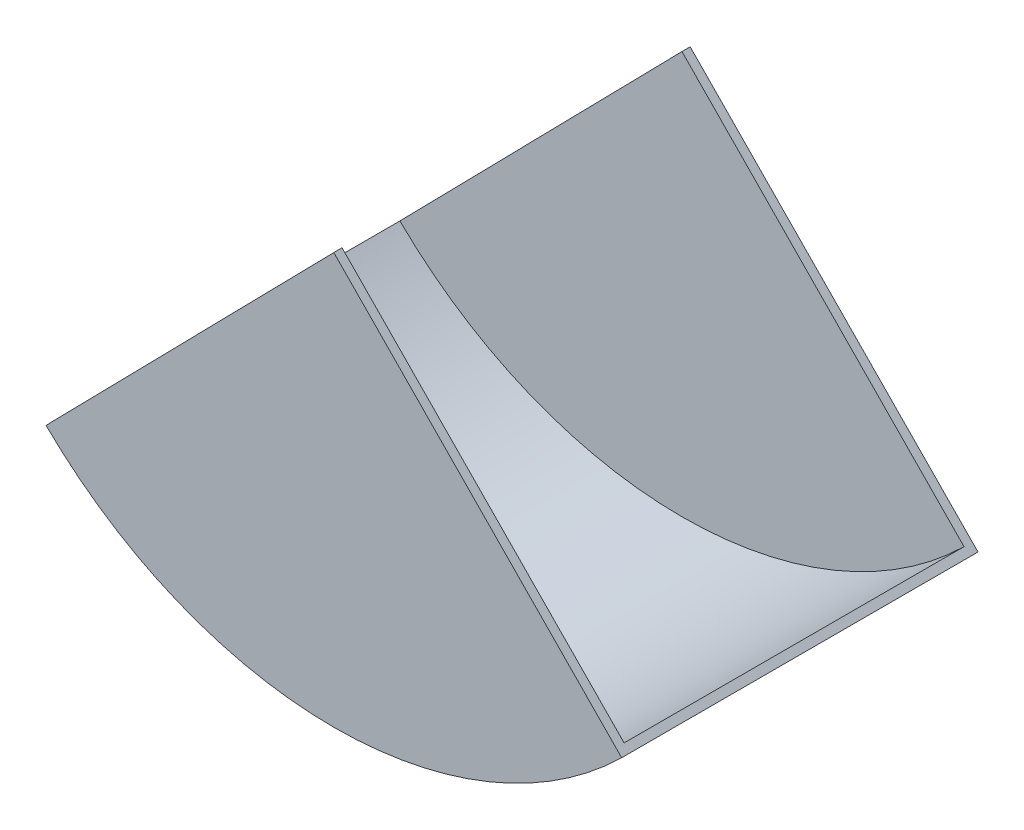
from build123d import *

# Parameters (mm, degrees)
EXTRUSION1_DEPTH        = 65
ENL_V_MAT_EXTRU_1_DEPTH = 62


with BuildPart() as part:
    # Esquisse1 → Extrusion1 (new, symmetric)
    with BuildSketch(Plane.XY):
        with BuildLine():
            Line((0, 0), (-105, -107.121426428))
            ThreePointArc((-105, -107.121426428), (0, -150), (105, -107.121426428))
            Line((105, -107.121426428), (0, 0))
        make_face()
    extrude(amount=EXTRUSION1_DEPTH, both=True)

    # Esquisse2 → Enl_v. mat.-Extru.1 (cut, symmetric)
    with BuildSketch(Plane.XY):
        with BuildLine():
            Line((-102.9, -104.9789979), (0, 0))
            Line((0, 0), (102.9, -104.9789979))
            ThreePointArc((102.9, -104.9789979), (0, -147), (-102.9, -104.9789979))
        make_face()
    extrude(amount=ENL_V_MAT_EXTRU_1_DEPTH, both=True, mode=Mode.SUBTRACT)


solid = part.part
